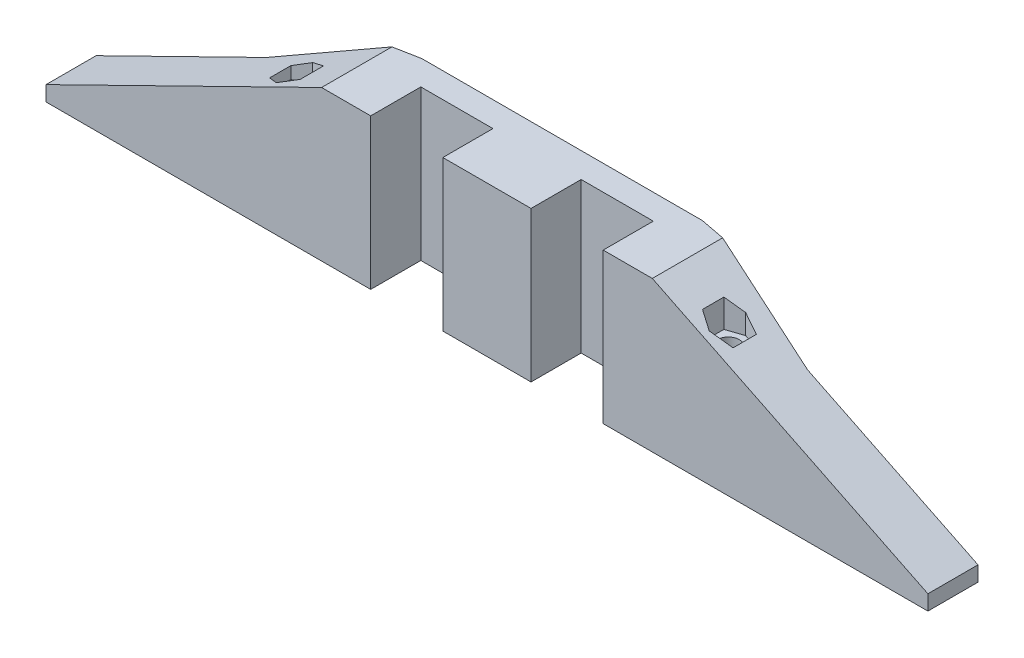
from build123d import *

# Parameters (mm, degrees)
EXTRUDE_1_DEPTH                 = 30
EXTRUDE_1_2_DEPTH               = 30
SKETCH_2_W                      = 15
SKETCH_2_H                      = 30
EXTRUDE_2_DEPTH                 = 8
SKETCH_3_W                      = 10
SKETCH_3_H                      = 30
EXTRUDE_3_DEPTH                 = 60
SKETCH_4_W                      = 10
SKETCH_4_H                      = 30
EXTRUDE_4_DEPTH                 = 60
EXTRUDE_5_DEPTH                 = 30
CUT_EXTRUDE_1_REACH             = 137.945
CUT_EXTRUDE_1_DIRECTION_2_REACH = 137.945
SKETCH_6_R                      = 2.1
CUT_EXTRUDE_2_DEPTH             = 60
CUT_EXTRUDE_START               = -9
SKETCH_7_R                      = 2.1
SKETCH_7_R_2                    = 2.2
CUT_EXTRUDE_3_DEPTH             = 9


with BuildPart() as part:
    # Sketch 1 → Extrude 1 (new body)
    with BuildSketch(Plane(origin=(0, 0, 0), x_dir=(1, 0, 0), z_dir=(0, 1, 0))):
        Polygon((-48.21632, 22.90322623), (-72.21632, 22.90322623), (-72.21632, 7.90322623), (-67.41632, 7.90322623), (-67.41632, 17.90322623), (-53.01632, 17.90322623), (-53.01632, 7.90322623), (-48.21632, 7.90322623), align=None)
    extrude(amount=EXTRUDE_1_DEPTH)



with BuildPart() as body_2:
    # Sketch 1 → Extrude 1 2 (new body)
    with BuildSketch(Plane(origin=(0, 0, 0), x_dir=(1, 0, 0), z_dir=(0, 1, 0))):
        Polygon((-40.21632, 22.90322623), (-40.21632, 7.90322623), (-35.41632, 7.90322623), (-35.41632, 17.90322623), (-21.01632, 17.90322623), (-21.01632, 7.90322623), (-16.21632, 7.90322623), (-16.21632, 22.90322623), align=None)
    extrude(amount=EXTRUDE_1_2_DEPTH)


with BuildPart() as part_1:
    add(part.part)

    add(body_2.part)  # Extrude 2 merges body 2
    # Sketch 2 → Extrude 2 (add)
    with BuildSketch(Plane(origin=(-48.21632, 0, 0), x_dir=(0, 0, -1), z_dir=(1, 0, 0))):
        with Locations((15.40322623, 15)):
            Rectangle(SKETCH_2_W, SKETCH_2_H)
    extrude(amount=EXTRUDE_2_DEPTH)

    # Sketch 3 → Extrude 3 (add)
    with BuildSketch(Plane.ZY.offset(72.21632)):
        with Locations((-12.90322623, 15)):
            Rectangle(SKETCH_3_W, SKETCH_3_H)
    extrude(amount=EXTRUDE_3_DEPTH)

    # Sketch 4 → Extrude 4 (add)
    with BuildSketch(Plane(origin=(-16.21632, 0, 0), x_dir=(0, 0, -1), z_dir=(1, 0, 0))):
        with Locations((12.90322623, 15)):
            Rectangle(SKETCH_4_W, SKETCH_4_H)
    extrude(amount=EXTRUDE_4_DEPTH)

    # Sketch 8 → Extrude 5 (add)
    with BuildSketch(Plane.XZ):
        Polygon((-16.21632, -17.90322623), (-16.21632, -22.90322623), (9.78368, -17.90322623), align=None)
        Polygon((-98.21632, -17.90322623), (-72.21632, -22.90322623), (-72.21632, -17.90322623), align=None)
    extrude(amount=-EXTRUDE_5_DEPTH)

    # Cut-Extrude 1: up to this face of the body (flat: up to its plane)
    cut_extrude_1_end = Plane(part_1.part.faces().sort_by_distance((11.38368, 15, -7.90322623))[0])
    # Sketch 5 → Cut-Extrude 1 (cut, up to the picked face)
    with BuildSketch(Plane(origin=(0, 0, -17.90322623), x_dir=(-1, 0, 0), z_dir=(0, 0, -1)), mode=Mode.PRIVATE) as cut_extrude_1_sk1:
        Polygon((11.21632, 30), (-43.78368, 30), (-43.78368, 3), align=None)
    cut_extrude_1_tool1 = split(extrude(cut_extrude_1_sk1.sketch, amount=-CUT_EXTRUDE_1_REACH, mode=Mode.PRIVATE), bisect_by=cut_extrude_1_end, keep=Keep.BOTH, mode=Mode.PRIVATE)
    # Sketch 5 → Cut-Extrude 1 (cut, up to the picked face)
    with BuildSketch(Plane(origin=(0, 0, -17.90322623), x_dir=(-1, 0, 0), z_dir=(0, 0, -1)), mode=Mode.PRIVATE) as cut_extrude_1_sk2:
        Polygon((77.21632, 30), (132.21632, 3), (132.21632, 30), align=None)
    cut_extrude_1_tool2 = split(extrude(cut_extrude_1_sk2.sketch, amount=-CUT_EXTRUDE_1_REACH, mode=Mode.PRIVATE), bisect_by=cut_extrude_1_end, keep=Keep.BOTH, mode=Mode.PRIVATE)
    add(cut_extrude_1_tool1.solids().sort_by(Axis((25.450347, 21, -17.903226), (0, 0, 1)))[0], mode=Mode.SUBTRACT)
    add(cut_extrude_1_tool2.solids().sort_by(Axis((-113.882987, 21, -17.903226), (0, 0, 1)))[0], mode=Mode.SUBTRACT)

    # Cut-Extrude 1 direction 2: up to this face of the body (flat: up to its plane)
    cut_extrude_1_direction_2_end = Plane(part_1.part.faces().sort_by_distance((-44.21632, 15, -22.90322623))[0])
    # Sketch 5 → Cut-Extrude 1 direction 2 (cut, up to the picked face)
    with BuildSketch(Plane(origin=(0, 0, -17.90322623), x_dir=(-1, 0, 0), z_dir=(0, 0, -1)), mode=Mode.PRIVATE) as cut_extrude_1_direction_2_sk1:
        Polygon((11.21632, 30), (-43.78368, 30), (-43.78368, 3), align=None)
    cut_extrude_1_direction_2_tool1 = split(extrude(cut_extrude_1_direction_2_sk1.sketch, amount=CUT_EXTRUDE_1_DIRECTION_2_REACH, mode=Mode.PRIVATE), bisect_by=cut_extrude_1_direction_2_end, keep=Keep.BOTH, mode=Mode.PRIVATE)
    # Sketch 5 → Cut-Extrude 1 direction 2 (cut, up to the picked face)
    with BuildSketch(Plane(origin=(0, 0, -17.90322623), x_dir=(-1, 0, 0), z_dir=(0, 0, -1)), mode=Mode.PRIVATE) as cut_extrude_1_direction_2_sk2:
        Polygon((77.21632, 30), (132.21632, 3), (132.21632, 30), align=None)
    cut_extrude_1_direction_2_tool2 = split(extrude(cut_extrude_1_direction_2_sk2.sketch, amount=CUT_EXTRUDE_1_DIRECTION_2_REACH, mode=Mode.PRIVATE), bisect_by=cut_extrude_1_direction_2_end, keep=Keep.BOTH, mode=Mode.PRIVATE)
    add(cut_extrude_1_direction_2_tool1.solids().sort_by(Axis((25.450347, 21, -17.903226), (0, 0, -1)))[0], mode=Mode.SUBTRACT)
    add(cut_extrude_1_direction_2_tool2.solids().sort_by(Axis((-113.882987, 21, -17.903226), (0, 0, -1)))[0], mode=Mode.SUBTRACT)

    # Sketch 6 → Cut-Extrude 2 (cut)
    with BuildSketch(Plane.XZ):
        with Locations(Location((-87.41632, -12.90322623, 0), (0, 0, 270))):
            Circle(SKETCH_6_R)
        with Locations(Location((-1.01632, -12.90322623, 0), (0, 0, 270))):
            Circle(SKETCH_6_R)
    extrude(amount=-CUT_EXTRUDE_2_DEPTH, mode=Mode.SUBTRACT)

    # Sketch 7 → Cut-Extrude 3 (cut)
    # profile 1 of 4: a face of its own
    with BuildSketch(Plane(origin=(0, 30, 0), x_dir=(1, 0, 0), z_dir=(0, 1, 0)).offset(CUT_EXTRUDE_START)):
        Polygon((2.23368, 15.236921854), (2.23368, 10.569530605), (-1.323164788, 9.369841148), (-4.26632, 10.972180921), (-4.26632, 15.236921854), (-1.01632, 16.333115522), align=None)
        with Locations(Location((-1.01632, 12.90322623, 0), (0, 0, 90))):
            Circle(SKETCH_7_R, mode=Mode.SUBTRACT)
    # profile 2 of 4: a face of its own
    with BuildSketch(Plane(origin=(0, 30, 0), x_dir=(1, 0, 0), z_dir=(0, 1, 0)).offset(CUT_EXTRUDE_START)):
        Polygon((-90.66632, 15.236921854), (-87.41632, 16.333115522), (-84.16632, 15.236921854), (-84.16632, 10.569530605), (-87.723164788, 9.369841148), (-90.66632, 10.972180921), align=None)
        with Locations(Location((-87.41632, 12.90322623, 0), (0, 0, 90))):
            Circle(SKETCH_7_R, mode=Mode.SUBTRACT)
    # profile 3 of 4: a face of its own
    with BuildSketch(Plane(origin=(0, 30, 0), x_dir=(1, 0, 0), z_dir=(0, 1, 0)).offset(CUT_EXTRUDE_START)):
        with Locations((-87.41632, 12.90322623)):
            Circle(SKETCH_7_R_2)
        with Locations(Location((-87.41632, 12.90322623, 0), (0, 0, 90))):
            Circle(SKETCH_7_R, mode=Mode.SUBTRACT)
    # profile 4 of 4: a face of its own
    with BuildSketch(Plane(origin=(0, 30, 0), x_dir=(1, 0, 0), z_dir=(0, 1, 0)).offset(CUT_EXTRUDE_START)):
        with Locations((-1.01632, 12.90322623)):
            Circle(SKETCH_7_R_2)
        with Locations(Location((-1.01632, 12.90322623, 0), (0, 0, 90))):
            Circle(SKETCH_7_R, mode=Mode.SUBTRACT)
    extrude(amount=CUT_EXTRUDE_3_DEPTH, mode=Mode.SUBTRACT)


solid = part_1.part
